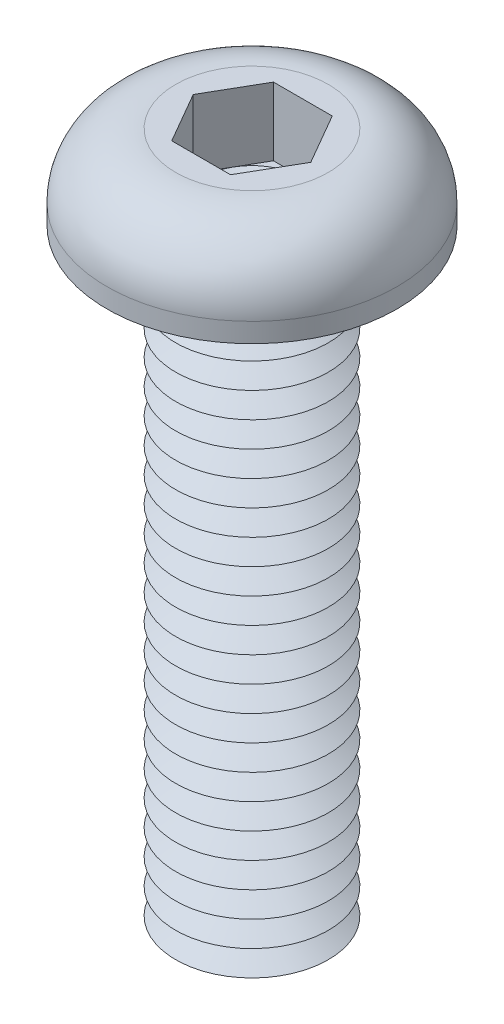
ISO-10303-21;
HEADER;
FILE_DESCRIPTION(('STEP AP214'),'2;1');
FILE_NAME('part.step','',(''),(''),'','','');
FILE_SCHEMA(('AUTOMOTIVE_DESIGN { 1 0 10303 214 1 1 1 1 }'));
ENDSEC;
DATA;
#1=APPLICATION_CONTEXT('core data for automotive mechanical design processes');
#2=APPLICATION_PROTOCOL_DEFINITION('international standard','automotive_design',2000,#1);
#3=PRODUCT_CONTEXT('',#1,'mechanical');
#4=PRODUCT('Part','Part','',(#3));
#5=PRODUCT_RELATED_PRODUCT_CATEGORY('part','',(#4));
#6=PRODUCT_DEFINITION_FORMATION('','',#4);
#7=PRODUCT_DEFINITION_CONTEXT('part definition',#1,'design');
#8=PRODUCT_DEFINITION('design','',#6,#7);
#9=PRODUCT_DEFINITION_SHAPE('','',#8);
#10=(LENGTH_UNIT() NAMED_UNIT(*) SI_UNIT(.MILLI.,.METRE.));
#11=(NAMED_UNIT(*) PLANE_ANGLE_UNIT() SI_UNIT($,.RADIAN.));
#12=(NAMED_UNIT(*) SI_UNIT($,.STERADIAN.) SOLID_ANGLE_UNIT());
#13=UNCERTAINTY_MEASURE_WITH_UNIT(LENGTH_MEASURE(1.E-05),#10,'distance_accuracy_value','');
#14=(GEOMETRIC_REPRESENTATION_CONTEXT(3) GLOBAL_UNCERTAINTY_ASSIGNED_CONTEXT((#13)) GLOBAL_UNIT_ASSIGNED_CONTEXT((#10,
#11,#12)) REPRESENTATION_CONTEXT('',''));
#15=CARTESIAN_POINT('',(0.,0.,0.));
#16=DIRECTION('',(0.,0.,1.));
#17=DIRECTION('',(1.,0.,0.));
#18=AXIS2_PLACEMENT_3D('',#15,#16,#17);
#19=CARTESIAN_POINT('',(0.,0.,0.));
#20=DIRECTION('',(0.,-1.,0.));
#21=DIRECTION('',(0.,0.,-1.));
#22=AXIS2_PLACEMENT_3D('',#19,#20,#21);
#23=TOROIDAL_SURFACE('',#22,1.75,0.25);
#24=CARTESIAN_POINT('',(0.,0.,-2.));
#25=VERTEX_POINT('',#24);
#26=VERTEX_LOOP('',#25);
#27=FACE_BOUND('',#26,.T.);
#28=ADVANCED_FACE('P0_F12',(#27),#23,.T.);
#29=CLOSED_SHELL('',(#28));
#30=MANIFOLD_SOLID_BREP('P0_B1',#29);
#31=CARTESIAN_POINT('',(0.577350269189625,0.31,-1.));
#32=DIRECTION('',(0.,1.,0.));
#33=DIRECTION('',(0.,0.,1.));
#34=AXIS2_PLACEMENT_3D('',#31,#32,#33);
#35=PLANE('',#34);
#36=CARTESIAN_POINT('',(0.,0.31,0.));
#37=DIRECTION('',(0.,1.,0.));
#38=DIRECTION('',(0.,0.,1.));
#39=AXIS2_PLACEMENT_3D('',#36,#37,#38);
#40=CIRCLE('',#39,1.);
#41=CARTESIAN_POINT('',(0.,0.31,1.));
#42=VERTEX_POINT('',#41);
#43=CARTESIAN_POINT('',(0.866025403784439,0.31,0.5));
#44=VERTEX_POINT('',#43);
#45=EDGE_CURVE('P1_E93',#42,#44,#40,.T.);
#46=ORIENTED_EDGE('',*,*,#45,.F.);
#47=DIRECTION('',(1.,0.,0.));
#48=VECTOR('',#47,1.);
#49=CARTESIAN_POINT('',(-0.577350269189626,0.31,1.));
#50=LINE('',#49,#48);
#51=CARTESIAN_POINT('',(0.577350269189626,0.31,1.));
#52=VERTEX_POINT('',#51);
#53=EDGE_CURVE('P1_E116',#42,#52,#50,.T.);
#54=ORIENTED_EDGE('',*,*,#53,.T.);
#55=DIRECTION('',(0.5,0.,-0.866025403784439));
#56=VECTOR('',#55,1.);
#57=CARTESIAN_POINT('',(0.577350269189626,0.31,1.));
#58=LINE('',#57,#56);
#59=EDGE_CURVE('P1_E112',#52,#44,#58,.T.);
#60=ORIENTED_EDGE('',*,*,#59,.T.);
#61=EDGE_LOOP('',(#46,#54,#60));
#62=FACE_BOUND('',#61,.T.);
#63=ADVANCED_FACE('P1_F15',(#62),#35,.T.);
#64=CARTESIAN_POINT('',(0.,0.31,0.));
#65=DIRECTION('',(0.,1.,0.));
#66=DIRECTION('',(0.,0.,1.));
#67=AXIS2_PLACEMENT_3D('',#64,#65,#66);
#68=CIRCLE('',#67,1.);
#69=CARTESIAN_POINT('',(0.866025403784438,0.31,-0.5));
#70=VERTEX_POINT('',#69);
#71=EDGE_CURVE('P1_E10',#44,#70,#68,.T.);
#72=ORIENTED_EDGE('',*,*,#71,.F.);
#73=CARTESIAN_POINT('',(1.15470053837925,0.31,0.));
#74=VERTEX_POINT('',#73);
#75=EDGE_CURVE('P1_E104',#44,#74,#58,.T.);
#76=ORIENTED_EDGE('',*,*,#75,.T.);
#77=DIRECTION('',(-0.5,0.,-0.866025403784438));
#78=VECTOR('',#77,1.);
#79=CARTESIAN_POINT('',(1.15470053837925,0.31,0.));
#80=LINE('',#79,#78);
#81=EDGE_CURVE('P1_E107',#74,#70,#80,.T.);
#82=ORIENTED_EDGE('',*,*,#81,.T.);
#83=EDGE_LOOP('',(#72,#76,#82));
#84=FACE_BOUND('',#83,.T.);
#85=ADVANCED_FACE('P1_F103',(#84),#35,.T.);
#86=CARTESIAN_POINT('',(0.,0.31,-1.));
#87=VERTEX_POINT('',#86);
#88=EDGE_CURVE('P1_E24',#70,#87,#68,.T.);
#89=ORIENTED_EDGE('',*,*,#88,.F.);
#90=CARTESIAN_POINT('',(0.577350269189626,0.31,-1.));
#91=VERTEX_POINT('',#90);
#92=EDGE_CURVE('P1_E139',#70,#91,#80,.T.);
#93=ORIENTED_EDGE('',*,*,#92,.T.);
#94=DIRECTION('',(-1.,0.,0.));
#95=VECTOR('',#94,1.);
#96=CARTESIAN_POINT('',(0.577350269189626,0.31,-1.));
#97=LINE('',#96,#95);
#98=EDGE_CURVE('P1_E360',#91,#87,#97,.T.);
#99=ORIENTED_EDGE('',*,*,#98,.T.);
#100=EDGE_LOOP('',(#89,#93,#99));
#101=FACE_BOUND('',#100,.T.);
#102=ADVANCED_FACE('P1_F325',(#101),#35,.T.);
#103=CARTESIAN_POINT('',(-0.866025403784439,0.31,-0.5));
#104=VERTEX_POINT('',#103);
#105=EDGE_CURVE('P1_E355',#87,#104,#68,.T.);
#106=ORIENTED_EDGE('',*,*,#105,.F.);
#107=CARTESIAN_POINT('',(-0.577350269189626,0.31,-1.));
#108=VERTEX_POINT('',#107);
#109=EDGE_CURVE('P1_E364',#87,#108,#97,.T.);
#110=ORIENTED_EDGE('',*,*,#109,.T.);
#111=DIRECTION('',(-0.5,0.,0.866025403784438));
#112=VECTOR('',#111,1.);
#113=CARTESIAN_POINT('',(-0.577350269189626,0.31,-1.));
#114=LINE('',#113,#112);
#115=EDGE_CURVE('P1_E359',#108,#104,#114,.T.);
#116=ORIENTED_EDGE('',*,*,#115,.T.);
#117=EDGE_LOOP('',(#106,#110,#116));
#118=FACE_BOUND('',#117,.T.);
#119=ADVANCED_FACE('P1_F339',(#118),#35,.T.);
#120=CARTESIAN_POINT('',(-0.866025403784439,0.31,0.5));
#121=VERTEX_POINT('',#120);
#122=EDGE_CURVE('P1_E31',#104,#121,#68,.T.);
#123=ORIENTED_EDGE('',*,*,#122,.F.);
#124=CARTESIAN_POINT('',(-1.15470053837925,0.31,0.));
#125=VERTEX_POINT('',#124);
#126=EDGE_CURVE('P1_E351',#104,#125,#114,.T.);
#127=ORIENTED_EDGE('',*,*,#126,.T.);
#128=DIRECTION('',(0.5,0.,0.866025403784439));
#129=VECTOR('',#128,1.);
#130=CARTESIAN_POINT('',(-1.15470053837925,0.31,0.));
#131=LINE('',#130,#129);
#132=EDGE_CURVE('P1_E354',#125,#121,#131,.T.);
#133=ORIENTED_EDGE('',*,*,#132,.T.);
#134=EDGE_LOOP('',(#123,#127,#133));
#135=FACE_BOUND('',#134,.T.);
#136=ADVANCED_FACE('P1_F330',(#135),#35,.T.);
#137=CARTESIAN_POINT('',(0.,-11.5,0.));
#138=DIRECTION('',(0.,1.,0.));
#139=DIRECTION('',(0.,0.,1.));
#140=AXIS2_PLACEMENT_3D('',#137,#138,#139);
#141=CONICAL_SURFACE('',#140,1.06698729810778,1.0471975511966);
#142=CARTESIAN_POINT('',(0.,-11.25,0.));
#143=DIRECTION('',(0.,-1.,0.));
#144=DIRECTION('',(0.,0.,-1.));
#145=AXIS2_PLACEMENT_3D('',#142,#143,#144);
#146=CIRCLE('',#145,1.5);
#147=CARTESIAN_POINT('',(0.,-11.25,-1.5));
#148=VERTEX_POINT('',#147);
#149=EDGE_CURVE('P1_E287',#148,#148,#146,.T.);
#150=ORIENTED_EDGE('',*,*,#149,.T.);
#151=EDGE_LOOP('',(#150));
#152=FACE_BOUND('',#151,.T.);
#153=CARTESIAN_POINT('',(0.,-11.5,0.));
#154=DIRECTION('',(0.,-1.,0.));
#155=DIRECTION('',(0.,0.,-1.));
#156=AXIS2_PLACEMENT_3D('',#153,#154,#155);
#157=CIRCLE('',#156,1.06698729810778);
#158=CARTESIAN_POINT('',(0.,-11.5,-1.06698729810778));
#159=VERTEX_POINT('',#158);
#160=EDGE_CURVE('P1_E290',#159,#159,#157,.T.);
#161=ORIENTED_EDGE('',*,*,#160,.F.);
#162=EDGE_LOOP('',(#161));
#163=FACE_BOUND('',#162,.T.);
#164=ADVANCED_FACE('P1_F338',(#152,#163),#141,.T.);
#165=CARTESIAN_POINT('',(0.,-11.75,0.));
#166=DIRECTION('',(0.,-1.,0.));
#167=DIRECTION('',(0.,0.,-1.));
#168=AXIS2_PLACEMENT_3D('',#165,#166,#167);
#169=CONICAL_SURFACE('',#168,1.5,1.0471975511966);
#170=ORIENTED_EDGE('',*,*,#160,.T.);
#171=EDGE_LOOP('',(#170));
#172=FACE_BOUND('',#171,.T.);
#173=CARTESIAN_POINT('',(0.,-11.75,0.));
#174=DIRECTION('',(0.,-1.,0.));
#175=DIRECTION('',(0.,0.,-1.));
#176=AXIS2_PLACEMENT_3D('',#173,#174,#175);
#177=CIRCLE('',#176,1.5);
#178=CARTESIAN_POINT('',(0.,-11.75,-1.5));
#179=VERTEX_POINT('',#178);
#180=EDGE_CURVE('P1_E293',#179,#179,#177,.T.);
#181=ORIENTED_EDGE('',*,*,#180,.F.);
#182=EDGE_LOOP('',(#181));
#183=FACE_BOUND('',#182,.T.);
#184=ADVANCED_FACE('P1_F345',(#172,#183),#169,.T.);
#185=CARTESIAN_POINT('',(0.,-12.,0.));
#186=DIRECTION('',(0.,1.,0.));
#187=DIRECTION('',(0.,0.,1.));
#188=AXIS2_PLACEMENT_3D('',#185,#186,#187);
#189=PLANE('',#188);
#190=CARTESIAN_POINT('',(0.,-12.,0.));
#191=DIRECTION('',(0.,-1.,0.));
#192=DIRECTION('',(0.,0.,-1.));
#193=AXIS2_PLACEMENT_3D('',#190,#191,#192);
#194=CIRCLE('',#193,1.06698729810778);
#195=CARTESIAN_POINT('',(0.,-12.,-1.06698729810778));
#196=VERTEX_POINT('',#195);
#197=EDGE_CURVE('P1_E296',#196,#196,#194,.T.);
#198=ORIENTED_EDGE('',*,*,#197,.T.);
#199=EDGE_LOOP('',(#198));
#200=FACE_BOUND('',#199,.T.);
#201=ADVANCED_FACE('P1_F423',(#200),#189,.F.);
#202=CARTESIAN_POINT('',(0.,-12.,0.));
#203=DIRECTION('',(0.,1.,0.));
#204=DIRECTION('',(0.,0.,1.));
#205=AXIS2_PLACEMENT_3D('',#202,#203,#204);
#206=CONICAL_SURFACE('',#205,1.06698729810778,1.0471975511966);
#207=ORIENTED_EDGE('',*,*,#180,.T.);
#208=EDGE_LOOP('',(#207));
#209=FACE_BOUND('',#208,.T.);
#210=ORIENTED_EDGE('',*,*,#197,.F.);
#211=EDGE_LOOP('',(#210));
#212=FACE_BOUND('',#211,.T.);
#213=ADVANCED_FACE('P1_F434',(#209,#212),#206,.T.);
#214=CARTESIAN_POINT('',(0.,-11.,0.));
#215=DIRECTION('',(0.,1.,0.));
#216=DIRECTION('',(0.,0.,1.));
#217=AXIS2_PLACEMENT_3D('',#214,#215,#216);
#218=CONICAL_SURFACE('',#217,1.06698729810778,1.0471975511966);
#219=CARTESIAN_POINT('',(0.,-10.75,0.));
#220=DIRECTION('',(0.,-1.,0.));
#221=DIRECTION('',(0.,0.,-1.));
#222=AXIS2_PLACEMENT_3D('',#219,#220,#221);
#223=CIRCLE('',#222,1.5);
#224=CARTESIAN_POINT('',(0.,-10.75,-1.5));
#225=VERTEX_POINT('',#224);
#226=EDGE_CURVE('P1_E281',#225,#225,#223,.T.);
#227=ORIENTED_EDGE('',*,*,#226,.T.);
#228=EDGE_LOOP('',(#227));
#229=FACE_BOUND('',#228,.T.);
#230=CARTESIAN_POINT('',(0.,-11.,0.));
#231=DIRECTION('',(0.,-1.,0.));
#232=DIRECTION('',(0.,0.,-1.));
#233=AXIS2_PLACEMENT_3D('',#230,#231,#232);
#234=CIRCLE('',#233,1.06698729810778);
#235=CARTESIAN_POINT('',(0.,-11.,-1.06698729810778));
#236=VERTEX_POINT('',#235);
#237=EDGE_CURVE('P1_E284',#236,#236,#234,.T.);
#238=ORIENTED_EDGE('',*,*,#237,.F.);
#239=EDGE_LOOP('',(#238));
#240=FACE_BOUND('',#239,.T.);
#241=ADVANCED_FACE('P1_F443',(#229,#240),#218,.T.);
#242=CARTESIAN_POINT('',(0.,-11.25,0.));
#243=DIRECTION('',(0.,-1.,0.));
#244=DIRECTION('',(0.,0.,-1.));
#245=AXIS2_PLACEMENT_3D('',#242,#243,#244);
#246=CONICAL_SURFACE('',#245,1.5,1.0471975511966);
#247=ORIENTED_EDGE('',*,*,#237,.T.);
#248=EDGE_LOOP('',(#247));
#249=FACE_BOUND('',#248,.T.);
#250=ORIENTED_EDGE('',*,*,#149,.F.);
#251=EDGE_LOOP('',(#250));
#252=FACE_BOUND('',#251,.T.);
#253=ADVANCED_FACE('P1_F452',(#249,#252),#246,.T.);
#254=CARTESIAN_POINT('',(0.,-10.5,0.));
#255=DIRECTION('',(0.,1.,0.));
#256=DIRECTION('',(0.,0.,1.));
#257=AXIS2_PLACEMENT_3D('',#254,#255,#256);
#258=CONICAL_SURFACE('',#257,1.06698729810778,1.0471975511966);
#259=CARTESIAN_POINT('',(0.,-10.25,0.));
#260=DIRECTION('',(0.,-1.,0.));
#261=DIRECTION('',(0.,0.,-1.));
#262=AXIS2_PLACEMENT_3D('',#259,#260,#261);
#263=CIRCLE('',#262,1.5);
#264=CARTESIAN_POINT('',(0.,-10.25,-1.5));
#265=VERTEX_POINT('',#264);
#266=EDGE_CURVE('P1_E275',#265,#265,#263,.T.);
#267=ORIENTED_EDGE('',*,*,#266,.T.);
#268=EDGE_LOOP('',(#267));
#269=FACE_BOUND('',#268,.T.);
#270=CARTESIAN_POINT('',(0.,-10.5,0.));
#271=DIRECTION('',(0.,-1.,0.));
#272=DIRECTION('',(0.,0.,-1.));
#273=AXIS2_PLACEMENT_3D('',#270,#271,#272);
#274=CIRCLE('',#273,1.06698729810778);
#275=CARTESIAN_POINT('',(0.,-10.5,-1.06698729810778));
#276=VERTEX_POINT('',#275);
#277=EDGE_CURVE('P1_E278',#276,#276,#274,.T.);
#278=ORIENTED_EDGE('',*,*,#277,.F.);
#279=EDGE_LOOP('',(#278));
#280=FACE_BOUND('',#279,.T.);
#281=ADVANCED_FACE('P1_F462',(#269,#280),#258,.T.);
#282=CARTESIAN_POINT('',(0.,-10.75,0.));
#283=DIRECTION('',(0.,-1.,0.));
#284=DIRECTION('',(0.,0.,-1.));
#285=AXIS2_PLACEMENT_3D('',#282,#283,#284);
#286=CONICAL_SURFACE('',#285,1.5,1.0471975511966);
#287=ORIENTED_EDGE('',*,*,#277,.T.);
#288=EDGE_LOOP('',(#287));
#289=FACE_BOUND('',#288,.T.);
#290=ORIENTED_EDGE('',*,*,#226,.F.);
#291=EDGE_LOOP('',(#290));
#292=FACE_BOUND('',#291,.T.);
#293=ADVANCED_FACE('P1_F472',(#289,#292),#286,.T.);
#294=CARTESIAN_POINT('',(0.,-10.,0.));
#295=DIRECTION('',(0.,1.,0.));
#296=DIRECTION('',(0.,0.,1.));
#297=AXIS2_PLACEMENT_3D('',#294,#295,#296);
#298=CONICAL_SURFACE('',#297,1.06698729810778,1.0471975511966);
#299=CARTESIAN_POINT('',(0.,-9.75,0.));
#300=DIRECTION('',(0.,-1.,0.));
#301=DIRECTION('',(0.,0.,-1.));
#302=AXIS2_PLACEMENT_3D('',#299,#300,#301);
#303=CIRCLE('',#302,1.5);
#304=CARTESIAN_POINT('',(0.,-9.75,-1.5));
#305=VERTEX_POINT('',#304);
#306=EDGE_CURVE('P1_E269',#305,#305,#303,.T.);
#307=ORIENTED_EDGE('',*,*,#306,.T.);
#308=EDGE_LOOP('',(#307));
#309=FACE_BOUND('',#308,.T.);
#310=CARTESIAN_POINT('',(0.,-10.,0.));
#311=DIRECTION('',(0.,-1.,0.));
#312=DIRECTION('',(0.,0.,-1.));
#313=AXIS2_PLACEMENT_3D('',#310,#311,#312);
#314=CIRCLE('',#313,1.06698729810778);
#315=CARTESIAN_POINT('',(0.,-10.,-1.06698729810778));
#316=VERTEX_POINT('',#315);
#317=EDGE_CURVE('P1_E272',#316,#316,#314,.T.);
#318=ORIENTED_EDGE('',*,*,#317,.F.);
#319=EDGE_LOOP('',(#318));
#320=FACE_BOUND('',#319,.T.);
#321=ADVANCED_FACE('P1_F482',(#309,#320),#298,.T.);
#322=CARTESIAN_POINT('',(0.,-10.25,0.));
#323=DIRECTION('',(0.,-1.,0.));
#324=DIRECTION('',(0.,0.,-1.));
#325=AXIS2_PLACEMENT_3D('',#322,#323,#324);
#326=CONICAL_SURFACE('',#325,1.5,1.0471975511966);
#327=ORIENTED_EDGE('',*,*,#317,.T.);
#328=EDGE_LOOP('',(#327));
#329=FACE_BOUND('',#328,.T.);
#330=ORIENTED_EDGE('',*,*,#266,.F.);
#331=EDGE_LOOP('',(#330));
#332=FACE_BOUND('',#331,.T.);
#333=ADVANCED_FACE('P1_F492',(#329,#332),#326,.T.);
#334=CARTESIAN_POINT('',(0.,-9.5,0.));
#335=DIRECTION('',(0.,1.,0.));
#336=DIRECTION('',(0.,0.,1.));
#337=AXIS2_PLACEMENT_3D('',#334,#335,#336);
#338=CONICAL_SURFACE('',#337,1.06698729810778,1.0471975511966);
#339=CARTESIAN_POINT('',(0.,-9.25,0.));
#340=DIRECTION('',(0.,-1.,0.));
#341=DIRECTION('',(0.,0.,-1.));
#342=AXIS2_PLACEMENT_3D('',#339,#340,#341);
#343=CIRCLE('',#342,1.5);
#344=CARTESIAN_POINT('',(0.,-9.25,-1.5));
#345=VERTEX_POINT('',#344);
#346=EDGE_CURVE('P1_E263',#345,#345,#343,.T.);
#347=ORIENTED_EDGE('',*,*,#346,.T.);
#348=EDGE_LOOP('',(#347));
#349=FACE_BOUND('',#348,.T.);
#350=CARTESIAN_POINT('',(0.,-9.5,0.));
#351=DIRECTION('',(0.,-1.,0.));
#352=DIRECTION('',(0.,0.,-1.));
#353=AXIS2_PLACEMENT_3D('',#350,#351,#352);
#354=CIRCLE('',#353,1.06698729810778);
#355=CARTESIAN_POINT('',(0.,-9.5,-1.06698729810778));
#356=VERTEX_POINT('',#355);
#357=EDGE_CURVE('P1_E266',#356,#356,#354,.T.);
#358=ORIENTED_EDGE('',*,*,#357,.F.);
#359=EDGE_LOOP('',(#358));
#360=FACE_BOUND('',#359,.T.);
#361=ADVANCED_FACE('P1_F502',(#349,#360),#338,.T.);
#362=CARTESIAN_POINT('',(0.,-9.75,0.));
#363=DIRECTION('',(0.,-1.,0.));
#364=DIRECTION('',(0.,0.,-1.));
#365=AXIS2_PLACEMENT_3D('',#362,#363,#364);
#366=CONICAL_SURFACE('',#365,1.5,1.0471975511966);
#367=ORIENTED_EDGE('',*,*,#357,.T.);
#368=EDGE_LOOP('',(#367));
#369=FACE_BOUND('',#368,.T.);
#370=ORIENTED_EDGE('',*,*,#306,.F.);
#371=EDGE_LOOP('',(#370));
#372=FACE_BOUND('',#371,.T.);
#373=ADVANCED_FACE('P1_F512',(#369,#372),#366,.T.);
#374=CARTESIAN_POINT('',(0.,-9.,0.));
#375=DIRECTION('',(0.,1.,0.));
#376=DIRECTION('',(0.,0.,1.));
#377=AXIS2_PLACEMENT_3D('',#374,#375,#376);
#378=CONICAL_SURFACE('',#377,1.06698729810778,1.0471975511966);
#379=CARTESIAN_POINT('',(0.,-8.75,0.));
#380=DIRECTION('',(0.,-1.,0.));
#381=DIRECTION('',(0.,0.,-1.));
#382=AXIS2_PLACEMENT_3D('',#379,#380,#381);
#383=CIRCLE('',#382,1.5);
#384=CARTESIAN_POINT('',(0.,-8.75,-1.5));
#385=VERTEX_POINT('',#384);
#386=EDGE_CURVE('P1_E257',#385,#385,#383,.T.);
#387=ORIENTED_EDGE('',*,*,#386,.T.);
#388=EDGE_LOOP('',(#387));
#389=FACE_BOUND('',#388,.T.);
#390=CARTESIAN_POINT('',(0.,-9.,0.));
#391=DIRECTION('',(0.,-1.,0.));
#392=DIRECTION('',(0.,0.,-1.));
#393=AXIS2_PLACEMENT_3D('',#390,#391,#392);
#394=CIRCLE('',#393,1.06698729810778);
#395=CARTESIAN_POINT('',(0.,-9.,-1.06698729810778));
#396=VERTEX_POINT('',#395);
#397=EDGE_CURVE('P1_E260',#396,#396,#394,.T.);
#398=ORIENTED_EDGE('',*,*,#397,.F.);
#399=EDGE_LOOP('',(#398));
#400=FACE_BOUND('',#399,.T.);
#401=ADVANCED_FACE('P1_F522',(#389,#400),#378,.T.);
#402=CARTESIAN_POINT('',(0.,-9.25,0.));
#403=DIRECTION('',(0.,-1.,0.));
#404=DIRECTION('',(0.,0.,-1.));
#405=AXIS2_PLACEMENT_3D('',#402,#403,#404);
#406=CONICAL_SURFACE('',#405,1.5,1.0471975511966);
#407=ORIENTED_EDGE('',*,*,#397,.T.);
#408=EDGE_LOOP('',(#407));
#409=FACE_BOUND('',#408,.T.);
#410=ORIENTED_EDGE('',*,*,#346,.F.);
#411=EDGE_LOOP('',(#410));
#412=FACE_BOUND('',#411,.T.);
#413=ADVANCED_FACE('P1_F532',(#409,#412),#406,.T.);
#414=CARTESIAN_POINT('',(0.,-8.5,0.));
#415=DIRECTION('',(0.,1.,0.));
#416=DIRECTION('',(0.,0.,1.));
#417=AXIS2_PLACEMENT_3D('',#414,#415,#416);
#418=CONICAL_SURFACE('',#417,1.06698729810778,1.0471975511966);
#419=CARTESIAN_POINT('',(0.,-8.25,0.));
#420=DIRECTION('',(0.,-1.,0.));
#421=DIRECTION('',(0.,0.,-1.));
#422=AXIS2_PLACEMENT_3D('',#419,#420,#421);
#423=CIRCLE('',#422,1.5);
#424=CARTESIAN_POINT('',(0.,-8.25,-1.5));
#425=VERTEX_POINT('',#424);
#426=EDGE_CURVE('P1_E251',#425,#425,#423,.T.);
#427=ORIENTED_EDGE('',*,*,#426,.T.);
#428=EDGE_LOOP('',(#427));
#429=FACE_BOUND('',#428,.T.);
#430=CARTESIAN_POINT('',(0.,-8.5,0.));
#431=DIRECTION('',(0.,-1.,0.));
#432=DIRECTION('',(0.,0.,-1.));
#433=AXIS2_PLACEMENT_3D('',#430,#431,#432);
#434=CIRCLE('',#433,1.06698729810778);
#435=CARTESIAN_POINT('',(0.,-8.5,-1.06698729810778));
#436=VERTEX_POINT('',#435);
#437=EDGE_CURVE('P1_E254',#436,#436,#434,.T.);
#438=ORIENTED_EDGE('',*,*,#437,.F.);
#439=EDGE_LOOP('',(#438));
#440=FACE_BOUND('',#439,.T.);
#441=ADVANCED_FACE('P1_F542',(#429,#440),#418,.T.);
#442=CARTESIAN_POINT('',(0.,-8.75,0.));
#443=DIRECTION('',(0.,-1.,0.));
#444=DIRECTION('',(0.,0.,-1.));
#445=AXIS2_PLACEMENT_3D('',#442,#443,#444);
#446=CONICAL_SURFACE('',#445,1.5,1.0471975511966);
#447=ORIENTED_EDGE('',*,*,#437,.T.);
#448=EDGE_LOOP('',(#447));
#449=FACE_BOUND('',#448,.T.);
#450=ORIENTED_EDGE('',*,*,#386,.F.);
#451=EDGE_LOOP('',(#450));
#452=FACE_BOUND('',#451,.T.);
#453=ADVANCED_FACE('P1_F552',(#449,#452),#446,.T.);
#454=CARTESIAN_POINT('',(0.,-8.,0.));
#455=DIRECTION('',(0.,1.,0.));
#456=DIRECTION('',(0.,0.,1.));
#457=AXIS2_PLACEMENT_3D('',#454,#455,#456);
#458=CONICAL_SURFACE('',#457,1.06698729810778,1.0471975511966);
#459=CARTESIAN_POINT('',(0.,-7.75,0.));
#460=DIRECTION('',(0.,-1.,0.));
#461=DIRECTION('',(0.,0.,-1.));
#462=AXIS2_PLACEMENT_3D('',#459,#460,#461);
#463=CIRCLE('',#462,1.5);
#464=CARTESIAN_POINT('',(0.,-7.75,-1.5));
#465=VERTEX_POINT('',#464);
#466=EDGE_CURVE('P1_E245',#465,#465,#463,.T.);
#467=ORIENTED_EDGE('',*,*,#466,.T.);
#468=EDGE_LOOP('',(#467));
#469=FACE_BOUND('',#468,.T.);
#470=CARTESIAN_POINT('',(0.,-8.,0.));
#471=DIRECTION('',(0.,-1.,0.));
#472=DIRECTION('',(0.,0.,-1.));
#473=AXIS2_PLACEMENT_3D('',#470,#471,#472);
#474=CIRCLE('',#473,1.06698729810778);
#475=CARTESIAN_POINT('',(0.,-8.,-1.06698729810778));
#476=VERTEX_POINT('',#475);
#477=EDGE_CURVE('P1_E248',#476,#476,#474,.T.);
#478=ORIENTED_EDGE('',*,*,#477,.F.);
#479=EDGE_LOOP('',(#478));
#480=FACE_BOUND('',#479,.T.);
#481=ADVANCED_FACE('P1_F562',(#469,#480),#458,.T.);
#482=CARTESIAN_POINT('',(0.,-8.25,0.));
#483=DIRECTION('',(0.,-1.,0.));
#484=DIRECTION('',(0.,0.,-1.));
#485=AXIS2_PLACEMENT_3D('',#482,#483,#484);
#486=CONICAL_SURFACE('',#485,1.5,1.0471975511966);
#487=ORIENTED_EDGE('',*,*,#477,.T.);
#488=EDGE_LOOP('',(#487));
#489=FACE_BOUND('',#488,.T.);
#490=ORIENTED_EDGE('',*,*,#426,.F.);
#491=EDGE_LOOP('',(#490));
#492=FACE_BOUND('',#491,.T.);
#493=ADVANCED_FACE('P1_F572',(#489,#492),#486,.T.);
#494=CARTESIAN_POINT('',(0.,-7.5,0.));
#495=DIRECTION('',(0.,1.,0.));
#496=DIRECTION('',(0.,0.,1.));
#497=AXIS2_PLACEMENT_3D('',#494,#495,#496);
#498=CONICAL_SURFACE('',#497,1.06698729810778,1.0471975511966);
#499=CARTESIAN_POINT('',(0.,-7.25,0.));
#500=DIRECTION('',(0.,-1.,0.));
#501=DIRECTION('',(0.,0.,-1.));
#502=AXIS2_PLACEMENT_3D('',#499,#500,#501);
#503=CIRCLE('',#502,1.5);
#504=CARTESIAN_POINT('',(0.,-7.25,-1.5));
#505=VERTEX_POINT('',#504);
#506=EDGE_CURVE('P1_E239',#505,#505,#503,.T.);
#507=ORIENTED_EDGE('',*,*,#506,.T.);
#508=EDGE_LOOP('',(#507));
#509=FACE_BOUND('',#508,.T.);
#510=CARTESIAN_POINT('',(0.,-7.5,0.));
#511=DIRECTION('',(0.,-1.,0.));
#512=DIRECTION('',(0.,0.,-1.));
#513=AXIS2_PLACEMENT_3D('',#510,#511,#512);
#514=CIRCLE('',#513,1.06698729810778);
#515=CARTESIAN_POINT('',(0.,-7.5,-1.06698729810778));
#516=VERTEX_POINT('',#515);
#517=EDGE_CURVE('P1_E242',#516,#516,#514,.T.);
#518=ORIENTED_EDGE('',*,*,#517,.F.);
#519=EDGE_LOOP('',(#518));
#520=FACE_BOUND('',#519,.T.);
#521=ADVANCED_FACE('P1_F582',(#509,#520),#498,.T.);
#522=CARTESIAN_POINT('',(0.,-7.75,0.));
#523=DIRECTION('',(0.,-1.,0.));
#524=DIRECTION('',(0.,0.,-1.));
#525=AXIS2_PLACEMENT_3D('',#522,#523,#524);
#526=CONICAL_SURFACE('',#525,1.5,1.0471975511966);
#527=ORIENTED_EDGE('',*,*,#517,.T.);
#528=EDGE_LOOP('',(#527));
#529=FACE_BOUND('',#528,.T.);
#530=ORIENTED_EDGE('',*,*,#466,.F.);
#531=EDGE_LOOP('',(#530));
#532=FACE_BOUND('',#531,.T.);
#533=ADVANCED_FACE('P1_F592',(#529,#532),#526,.T.);
#534=CARTESIAN_POINT('',(0.,-7.,0.));
#535=DIRECTION('',(0.,1.,0.));
#536=DIRECTION('',(0.,0.,1.));
#537=AXIS2_PLACEMENT_3D('',#534,#535,#536);
#538=CONICAL_SURFACE('',#537,1.06698729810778,1.0471975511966);
#539=CARTESIAN_POINT('',(0.,-6.75,0.));
#540=DIRECTION('',(0.,-1.,0.));
#541=DIRECTION('',(0.,0.,-1.));
#542=AXIS2_PLACEMENT_3D('',#539,#540,#541);
#543=CIRCLE('',#542,1.5);
#544=CARTESIAN_POINT('',(0.,-6.75,-1.5));
#545=VERTEX_POINT('',#544);
#546=EDGE_CURVE('P1_E233',#545,#545,#543,.T.);
#547=ORIENTED_EDGE('',*,*,#546,.T.);
#548=EDGE_LOOP('',(#547));
#549=FACE_BOUND('',#548,.T.);
#550=CARTESIAN_POINT('',(0.,-7.,0.));
#551=DIRECTION('',(0.,-1.,0.));
#552=DIRECTION('',(0.,0.,-1.));
#553=AXIS2_PLACEMENT_3D('',#550,#551,#552);
#554=CIRCLE('',#553,1.06698729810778);
#555=CARTESIAN_POINT('',(0.,-7.,-1.06698729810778));
#556=VERTEX_POINT('',#555);
#557=EDGE_CURVE('P1_E236',#556,#556,#554,.T.);
#558=ORIENTED_EDGE('',*,*,#557,.F.);
#559=EDGE_LOOP('',(#558));
#560=FACE_BOUND('',#559,.T.);
#561=ADVANCED_FACE('P1_F602',(#549,#560),#538,.T.);
#562=CARTESIAN_POINT('',(0.,-7.25,0.));
#563=DIRECTION('',(0.,-1.,0.));
#564=DIRECTION('',(0.,0.,-1.));
#565=AXIS2_PLACEMENT_3D('',#562,#563,#564);
#566=CONICAL_SURFACE('',#565,1.5,1.0471975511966);
#567=ORIENTED_EDGE('',*,*,#557,.T.);
#568=EDGE_LOOP('',(#567));
#569=FACE_BOUND('',#568,.T.);
#570=ORIENTED_EDGE('',*,*,#506,.F.);
#571=EDGE_LOOP('',(#570));
#572=FACE_BOUND('',#571,.T.);
#573=ADVANCED_FACE('P1_F612',(#569,#572),#566,.T.);
#574=CARTESIAN_POINT('',(0.,-6.5,0.));
#575=DIRECTION('',(0.,1.,0.));
#576=DIRECTION('',(0.,0.,1.));
#577=AXIS2_PLACEMENT_3D('',#574,#575,#576);
#578=CONICAL_SURFACE('',#577,1.06698729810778,1.0471975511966);
#579=CARTESIAN_POINT('',(0.,-6.25,0.));
#580=DIRECTION('',(0.,-1.,0.));
#581=DIRECTION('',(0.,0.,-1.));
#582=AXIS2_PLACEMENT_3D('',#579,#580,#581);
#583=CIRCLE('',#582,1.5);
#584=CARTESIAN_POINT('',(0.,-6.25,-1.5));
#585=VERTEX_POINT('',#584);
#586=EDGE_CURVE('P1_E227',#585,#585,#583,.T.);
#587=ORIENTED_EDGE('',*,*,#586,.T.);
#588=EDGE_LOOP('',(#587));
#589=FACE_BOUND('',#588,.T.);
#590=CARTESIAN_POINT('',(0.,-6.5,0.));
#591=DIRECTION('',(0.,-1.,0.));
#592=DIRECTION('',(0.,0.,-1.));
#593=AXIS2_PLACEMENT_3D('',#590,#591,#592);
#594=CIRCLE('',#593,1.06698729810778);
#595=CARTESIAN_POINT('',(0.,-6.5,-1.06698729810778));
#596=VERTEX_POINT('',#595);
#597=EDGE_CURVE('P1_E230',#596,#596,#594,.T.);
#598=ORIENTED_EDGE('',*,*,#597,.F.);
#599=EDGE_LOOP('',(#598));
#600=FACE_BOUND('',#599,.T.);
#601=ADVANCED_FACE('P1_F622',(#589,#600),#578,.T.);
#602=CARTESIAN_POINT('',(0.,-6.75,0.));
#603=DIRECTION('',(0.,-1.,0.));
#604=DIRECTION('',(0.,0.,-1.));
#605=AXIS2_PLACEMENT_3D('',#602,#603,#604);
#606=CONICAL_SURFACE('',#605,1.5,1.0471975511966);
#607=ORIENTED_EDGE('',*,*,#597,.T.);
#608=EDGE_LOOP('',(#607));
#609=FACE_BOUND('',#608,.T.);
#610=ORIENTED_EDGE('',*,*,#546,.F.);
#611=EDGE_LOOP('',(#610));
#612=FACE_BOUND('',#611,.T.);
#613=ADVANCED_FACE('P1_F632',(#609,#612),#606,.T.);
#614=CARTESIAN_POINT('',(0.,-6.,0.));
#615=DIRECTION('',(0.,1.,0.));
#616=DIRECTION('',(0.,0.,1.));
#617=AXIS2_PLACEMENT_3D('',#614,#615,#616);
#618=CONICAL_SURFACE('',#617,1.06698729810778,1.0471975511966);
#619=CARTESIAN_POINT('',(0.,-5.75,0.));
#620=DIRECTION('',(0.,-1.,0.));
#621=DIRECTION('',(0.,0.,-1.));
#622=AXIS2_PLACEMENT_3D('',#619,#620,#621);
#623=CIRCLE('',#622,1.5);
#624=CARTESIAN_POINT('',(0.,-5.75,-1.5));
#625=VERTEX_POINT('',#624);
#626=EDGE_CURVE('P1_E221',#625,#625,#623,.T.);
#627=ORIENTED_EDGE('',*,*,#626,.T.);
#628=EDGE_LOOP('',(#627));
#629=FACE_BOUND('',#628,.T.);
#630=CARTESIAN_POINT('',(0.,-6.,0.));
#631=DIRECTION('',(0.,-1.,0.));
#632=DIRECTION('',(0.,0.,-1.));
#633=AXIS2_PLACEMENT_3D('',#630,#631,#632);
#634=CIRCLE('',#633,1.06698729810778);
#635=CARTESIAN_POINT('',(0.,-6.,-1.06698729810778));
#636=VERTEX_POINT('',#635);
#637=EDGE_CURVE('P1_E224',#636,#636,#634,.T.);
#638=ORIENTED_EDGE('',*,*,#637,.F.);
#639=EDGE_LOOP('',(#638));
#640=FACE_BOUND('',#639,.T.);
#641=ADVANCED_FACE('P1_F642',(#629,#640),#618,.T.);
#642=CARTESIAN_POINT('',(0.,-6.25,0.));
#643=DIRECTION('',(0.,-1.,0.));
#644=DIRECTION('',(0.,0.,-1.));
#645=AXIS2_PLACEMENT_3D('',#642,#643,#644);
#646=CONICAL_SURFACE('',#645,1.5,1.0471975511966);
#647=ORIENTED_EDGE('',*,*,#637,.T.);
#648=EDGE_LOOP('',(#647));
#649=FACE_BOUND('',#648,.T.);
#650=ORIENTED_EDGE('',*,*,#586,.F.);
#651=EDGE_LOOP('',(#650));
#652=FACE_BOUND('',#651,.T.);
#653=ADVANCED_FACE('P1_F652',(#649,#652),#646,.T.);
#654=CARTESIAN_POINT('',(0.,-5.5,0.));
#655=DIRECTION('',(0.,1.,0.));
#656=DIRECTION('',(0.,0.,1.));
#657=AXIS2_PLACEMENT_3D('',#654,#655,#656);
#658=CONICAL_SURFACE('',#657,1.06698729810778,1.0471975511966);
#659=CARTESIAN_POINT('',(0.,-5.25,0.));
#660=DIRECTION('',(0.,-1.,0.));
#661=DIRECTION('',(0.,0.,-1.));
#662=AXIS2_PLACEMENT_3D('',#659,#660,#661);
#663=CIRCLE('',#662,1.5);
#664=CARTESIAN_POINT('',(0.,-5.25,-1.5));
#665=VERTEX_POINT('',#664);
#666=EDGE_CURVE('P1_E215',#665,#665,#663,.T.);
#667=ORIENTED_EDGE('',*,*,#666,.T.);
#668=EDGE_LOOP('',(#667));
#669=FACE_BOUND('',#668,.T.);
#670=CARTESIAN_POINT('',(0.,-5.5,0.));
#671=DIRECTION('',(0.,-1.,0.));
#672=DIRECTION('',(0.,0.,-1.));
#673=AXIS2_PLACEMENT_3D('',#670,#671,#672);
#674=CIRCLE('',#673,1.06698729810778);
#675=CARTESIAN_POINT('',(0.,-5.5,-1.06698729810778));
#676=VERTEX_POINT('',#675);
#677=EDGE_CURVE('P1_E218',#676,#676,#674,.T.);
#678=ORIENTED_EDGE('',*,*,#677,.F.);
#679=EDGE_LOOP('',(#678));
#680=FACE_BOUND('',#679,.T.);
#681=ADVANCED_FACE('P1_F662',(#669,#680),#658,.T.);
#682=CARTESIAN_POINT('',(0.,-5.75,0.));
#683=DIRECTION('',(0.,-1.,0.));
#684=DIRECTION('',(0.,0.,-1.));
#685=AXIS2_PLACEMENT_3D('',#682,#683,#684);
#686=CONICAL_SURFACE('',#685,1.5,1.0471975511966);
#687=ORIENTED_EDGE('',*,*,#677,.T.);
#688=EDGE_LOOP('',(#687));
#689=FACE_BOUND('',#688,.T.);
#690=ORIENTED_EDGE('',*,*,#626,.F.);
#691=EDGE_LOOP('',(#690));
#692=FACE_BOUND('',#691,.T.);
#693=ADVANCED_FACE('P1_F672',(#689,#692),#686,.T.);
#694=CARTESIAN_POINT('',(0.,-5.,0.));
#695=DIRECTION('',(0.,1.,0.));
#696=DIRECTION('',(0.,0.,1.));
#697=AXIS2_PLACEMENT_3D('',#694,#695,#696);
#698=CONICAL_SURFACE('',#697,1.06698729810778,1.0471975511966);
#699=CARTESIAN_POINT('',(0.,-4.75,0.));
#700=DIRECTION('',(0.,-1.,0.));
#701=DIRECTION('',(0.,0.,-1.));
#702=AXIS2_PLACEMENT_3D('',#699,#700,#701);
#703=CIRCLE('',#702,1.5);
#704=CARTESIAN_POINT('',(0.,-4.75,-1.5));
#705=VERTEX_POINT('',#704);
#706=EDGE_CURVE('P1_E209',#705,#705,#703,.T.);
#707=ORIENTED_EDGE('',*,*,#706,.T.);
#708=EDGE_LOOP('',(#707));
#709=FACE_BOUND('',#708,.T.);
#710=CARTESIAN_POINT('',(0.,-5.,0.));
#711=DIRECTION('',(0.,-1.,0.));
#712=DIRECTION('',(0.,0.,-1.));
#713=AXIS2_PLACEMENT_3D('',#710,#711,#712);
#714=CIRCLE('',#713,1.06698729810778);
#715=CARTESIAN_POINT('',(0.,-5.,-1.06698729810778));
#716=VERTEX_POINT('',#715);
#717=EDGE_CURVE('P1_E212',#716,#716,#714,.T.);
#718=ORIENTED_EDGE('',*,*,#717,.F.);
#719=EDGE_LOOP('',(#718));
#720=FACE_BOUND('',#719,.T.);
#721=ADVANCED_FACE('P1_F682',(#709,#720),#698,.T.);
#722=CARTESIAN_POINT('',(0.,-5.25,0.));
#723=DIRECTION('',(0.,-1.,0.));
#724=DIRECTION('',(0.,0.,-1.));
#725=AXIS2_PLACEMENT_3D('',#722,#723,#724);
#726=CONICAL_SURFACE('',#725,1.5,1.0471975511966);
#727=ORIENTED_EDGE('',*,*,#717,.T.);
#728=EDGE_LOOP('',(#727));
#729=FACE_BOUND('',#728,.T.);
#730=ORIENTED_EDGE('',*,*,#666,.F.);
#731=EDGE_LOOP('',(#730));
#732=FACE_BOUND('',#731,.T.);
#733=ADVANCED_FACE('P1_F692',(#729,#732),#726,.T.);
#734=CARTESIAN_POINT('',(0.,-4.5,0.));
#735=DIRECTION('',(0.,1.,0.));
#736=DIRECTION('',(0.,0.,1.));
#737=AXIS2_PLACEMENT_3D('',#734,#735,#736);
#738=CONICAL_SURFACE('',#737,1.06698729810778,1.0471975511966);
#739=CARTESIAN_POINT('',(0.,-4.25,0.));
#740=DIRECTION('',(0.,-1.,0.));
#741=DIRECTION('',(0.,0.,-1.));
#742=AXIS2_PLACEMENT_3D('',#739,#740,#741);
#743=CIRCLE('',#742,1.5);
#744=CARTESIAN_POINT('',(0.,-4.25,-1.5));
#745=VERTEX_POINT('',#744);
#746=EDGE_CURVE('P1_E203',#745,#745,#743,.T.);
#747=ORIENTED_EDGE('',*,*,#746,.T.);
#748=EDGE_LOOP('',(#747));
#749=FACE_BOUND('',#748,.T.);
#750=CARTESIAN_POINT('',(0.,-4.5,0.));
#751=DIRECTION('',(0.,-1.,0.));
#752=DIRECTION('',(0.,0.,-1.));
#753=AXIS2_PLACEMENT_3D('',#750,#751,#752);
#754=CIRCLE('',#753,1.06698729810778);
#755=CARTESIAN_POINT('',(0.,-4.5,-1.06698729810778));
#756=VERTEX_POINT('',#755);
#757=EDGE_CURVE('P1_E206',#756,#756,#754,.T.);
#758=ORIENTED_EDGE('',*,*,#757,.F.);
#759=EDGE_LOOP('',(#758));
#760=FACE_BOUND('',#759,.T.);
#761=ADVANCED_FACE('P1_F702',(#749,#760),#738,.T.);
#762=CARTESIAN_POINT('',(0.,-4.75,0.));
#763=DIRECTION('',(0.,-1.,0.));
#764=DIRECTION('',(0.,0.,-1.));
#765=AXIS2_PLACEMENT_3D('',#762,#763,#764);
#766=CONICAL_SURFACE('',#765,1.5,1.0471975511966);
#767=ORIENTED_EDGE('',*,*,#757,.T.);
#768=EDGE_LOOP('',(#767));
#769=FACE_BOUND('',#768,.T.);
#770=ORIENTED_EDGE('',*,*,#706,.F.);
#771=EDGE_LOOP('',(#770));
#772=FACE_BOUND('',#771,.T.);
#773=ADVANCED_FACE('P1_F712',(#769,#772),#766,.T.);
#774=CARTESIAN_POINT('',(0.,-4.,0.));
#775=DIRECTION('',(0.,1.,0.));
#776=DIRECTION('',(0.,0.,1.));
#777=AXIS2_PLACEMENT_3D('',#774,#775,#776);
#778=CONICAL_SURFACE('',#777,1.06698729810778,1.0471975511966);
#779=CARTESIAN_POINT('',(0.,-3.75,0.));
#780=DIRECTION('',(0.,-1.,0.));
#781=DIRECTION('',(0.,0.,-1.));
#782=AXIS2_PLACEMENT_3D('',#779,#780,#781);
#783=CIRCLE('',#782,1.5);
#784=CARTESIAN_POINT('',(0.,-3.75,-1.5));
#785=VERTEX_POINT('',#784);
#786=EDGE_CURVE('P1_E197',#785,#785,#783,.T.);
#787=ORIENTED_EDGE('',*,*,#786,.T.);
#788=EDGE_LOOP('',(#787));
#789=FACE_BOUND('',#788,.T.);
#790=CARTESIAN_POINT('',(0.,-4.,0.));
#791=DIRECTION('',(0.,-1.,0.));
#792=DIRECTION('',(0.,0.,-1.));
#793=AXIS2_PLACEMENT_3D('',#790,#791,#792);
#794=CIRCLE('',#793,1.06698729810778);
#795=CARTESIAN_POINT('',(0.,-4.,-1.06698729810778));
#796=VERTEX_POINT('',#795);
#797=EDGE_CURVE('P1_E200',#796,#796,#794,.T.);
#798=ORIENTED_EDGE('',*,*,#797,.F.);
#799=EDGE_LOOP('',(#798));
#800=FACE_BOUND('',#799,.T.);
#801=ADVANCED_FACE('P1_F722',(#789,#800),#778,.T.);
#802=CARTESIAN_POINT('',(0.,-4.25,0.));
#803=DIRECTION('',(0.,-1.,0.));
#804=DIRECTION('',(0.,0.,-1.));
#805=AXIS2_PLACEMENT_3D('',#802,#803,#804);
#806=CONICAL_SURFACE('',#805,1.5,1.0471975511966);
#807=ORIENTED_EDGE('',*,*,#797,.T.);
#808=EDGE_LOOP('',(#807));
#809=FACE_BOUND('',#808,.T.);
#810=ORIENTED_EDGE('',*,*,#746,.F.);
#811=EDGE_LOOP('',(#810));
#812=FACE_BOUND('',#811,.T.);
#813=ADVANCED_FACE('P1_F732',(#809,#812),#806,.T.);
#814=CARTESIAN_POINT('',(0.,-3.5,0.));
#815=DIRECTION('',(0.,1.,0.));
#816=DIRECTION('',(0.,0.,1.));
#817=AXIS2_PLACEMENT_3D('',#814,#815,#816);
#818=CONICAL_SURFACE('',#817,1.06698729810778,1.0471975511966);
#819=CARTESIAN_POINT('',(0.,-3.25,0.));
#820=DIRECTION('',(0.,-1.,0.));
#821=DIRECTION('',(0.,0.,-1.));
#822=AXIS2_PLACEMENT_3D('',#819,#820,#821);
#823=CIRCLE('',#822,1.5);
#824=CARTESIAN_POINT('',(0.,-3.25,-1.5));
#825=VERTEX_POINT('',#824);
#826=EDGE_CURVE('P1_E191',#825,#825,#823,.T.);
#827=ORIENTED_EDGE('',*,*,#826,.T.);
#828=EDGE_LOOP('',(#827));
#829=FACE_BOUND('',#828,.T.);
#830=CARTESIAN_POINT('',(0.,-3.5,0.));
#831=DIRECTION('',(0.,-1.,0.));
#832=DIRECTION('',(0.,0.,-1.));
#833=AXIS2_PLACEMENT_3D('',#830,#831,#832);
#834=CIRCLE('',#833,1.06698729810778);
#835=CARTESIAN_POINT('',(0.,-3.5,-1.06698729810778));
#836=VERTEX_POINT('',#835);
#837=EDGE_CURVE('P1_E194',#836,#836,#834,.T.);
#838=ORIENTED_EDGE('',*,*,#837,.F.);
#839=EDGE_LOOP('',(#838));
#840=FACE_BOUND('',#839,.T.);
#841=ADVANCED_FACE('P1_F742',(#829,#840),#818,.T.);
#842=CARTESIAN_POINT('',(0.,-3.75,0.));
#843=DIRECTION('',(0.,-1.,0.));
#844=DIRECTION('',(0.,0.,-1.));
#845=AXIS2_PLACEMENT_3D('',#842,#843,#844);
#846=CONICAL_SURFACE('',#845,1.5,1.0471975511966);
#847=ORIENTED_EDGE('',*,*,#837,.T.);
#848=EDGE_LOOP('',(#847));
#849=FACE_BOUND('',#848,.T.);
#850=ORIENTED_EDGE('',*,*,#786,.F.);
#851=EDGE_LOOP('',(#850));
#852=FACE_BOUND('',#851,.T.);
#853=ADVANCED_FACE('P1_F752',(#849,#852),#846,.T.);
#854=CARTESIAN_POINT('',(0.,-3.,0.));
#855=DIRECTION('',(0.,1.,0.));
#856=DIRECTION('',(0.,0.,1.));
#857=AXIS2_PLACEMENT_3D('',#854,#855,#856);
#858=CONICAL_SURFACE('',#857,1.06698729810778,1.0471975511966);
#859=CARTESIAN_POINT('',(0.,-2.75,0.));
#860=DIRECTION('',(0.,-1.,0.));
#861=DIRECTION('',(0.,0.,-1.));
#862=AXIS2_PLACEMENT_3D('',#859,#860,#861);
#863=CIRCLE('',#862,1.5);
#864=CARTESIAN_POINT('',(0.,-2.75,-1.5));
#865=VERTEX_POINT('',#864);
#866=EDGE_CURVE('P1_E185',#865,#865,#863,.T.);
#867=ORIENTED_EDGE('',*,*,#866,.T.);
#868=EDGE_LOOP('',(#867));
#869=FACE_BOUND('',#868,.T.);
#870=CARTESIAN_POINT('',(0.,-3.,0.));
#871=DIRECTION('',(0.,-1.,0.));
#872=DIRECTION('',(0.,0.,-1.));
#873=AXIS2_PLACEMENT_3D('',#870,#871,#872);
#874=CIRCLE('',#873,1.06698729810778);
#875=CARTESIAN_POINT('',(0.,-3.,-1.06698729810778));
#876=VERTEX_POINT('',#875);
#877=EDGE_CURVE('P1_E188',#876,#876,#874,.T.);
#878=ORIENTED_EDGE('',*,*,#877,.F.);
#879=EDGE_LOOP('',(#878));
#880=FACE_BOUND('',#879,.T.);
#881=ADVANCED_FACE('P1_F762',(#869,#880),#858,.T.);
#882=CARTESIAN_POINT('',(0.,-3.25,0.));
#883=DIRECTION('',(0.,-1.,0.));
#884=DIRECTION('',(0.,0.,-1.));
#885=AXIS2_PLACEMENT_3D('',#882,#883,#884);
#886=CONICAL_SURFACE('',#885,1.5,1.0471975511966);
#887=ORIENTED_EDGE('',*,*,#877,.T.);
#888=EDGE_LOOP('',(#887));
#889=FACE_BOUND('',#888,.T.);
#890=ORIENTED_EDGE('',*,*,#826,.F.);
#891=EDGE_LOOP('',(#890));
#892=FACE_BOUND('',#891,.T.);
#893=ADVANCED_FACE('P1_F772',(#889,#892),#886,.T.);
#894=CARTESIAN_POINT('',(0.,-2.5,0.));
#895=DIRECTION('',(0.,1.,0.));
#896=DIRECTION('',(0.,0.,1.));
#897=AXIS2_PLACEMENT_3D('',#894,#895,#896);
#898=CONICAL_SURFACE('',#897,1.06698729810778,1.0471975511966);
#899=CARTESIAN_POINT('',(0.,-2.25,0.));
#900=DIRECTION('',(0.,-1.,0.));
#901=DIRECTION('',(0.,0.,-1.));
#902=AXIS2_PLACEMENT_3D('',#899,#900,#901);
#903=CIRCLE('',#902,1.5);
#904=CARTESIAN_POINT('',(0.,-2.25,-1.5));
#905=VERTEX_POINT('',#904);
#906=EDGE_CURVE('P1_E179',#905,#905,#903,.T.);
#907=ORIENTED_EDGE('',*,*,#906,.T.);
#908=EDGE_LOOP('',(#907));
#909=FACE_BOUND('',#908,.T.);
#910=CARTESIAN_POINT('',(0.,-2.5,0.));
#911=DIRECTION('',(0.,-1.,0.));
#912=DIRECTION('',(0.,0.,-1.));
#913=AXIS2_PLACEMENT_3D('',#910,#911,#912);
#914=CIRCLE('',#913,1.06698729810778);
#915=CARTESIAN_POINT('',(0.,-2.5,-1.06698729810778));
#916=VERTEX_POINT('',#915);
#917=EDGE_CURVE('P1_E182',#916,#916,#914,.T.);
#918=ORIENTED_EDGE('',*,*,#917,.F.);
#919=EDGE_LOOP('',(#918));
#920=FACE_BOUND('',#919,.T.);
#921=ADVANCED_FACE('P1_F782',(#909,#920),#898,.T.);
#922=CARTESIAN_POINT('',(0.,-2.75,0.));
#923=DIRECTION('',(0.,-1.,0.));
#924=DIRECTION('',(0.,0.,-1.));
#925=AXIS2_PLACEMENT_3D('',#922,#923,#924);
#926=CONICAL_SURFACE('',#925,1.5,1.0471975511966);
#927=ORIENTED_EDGE('',*,*,#917,.T.);
#928=EDGE_LOOP('',(#927));
#929=FACE_BOUND('',#928,.T.);
#930=ORIENTED_EDGE('',*,*,#866,.F.);
#931=EDGE_LOOP('',(#930));
#932=FACE_BOUND('',#931,.T.);
#933=ADVANCED_FACE('P1_F792',(#929,#932),#926,.T.);
#934=CARTESIAN_POINT('',(0.,-2.,0.));
#935=DIRECTION('',(0.,1.,0.));
#936=DIRECTION('',(0.,0.,1.));
#937=AXIS2_PLACEMENT_3D('',#934,#935,#936);
#938=CONICAL_SURFACE('',#937,1.06698729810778,1.0471975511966);
#939=CARTESIAN_POINT('',(0.,-1.75,0.));
#940=DIRECTION('',(0.,-1.,0.));
#941=DIRECTION('',(0.,0.,-1.));
#942=AXIS2_PLACEMENT_3D('',#939,#940,#941);
#943=CIRCLE('',#942,1.5);
#944=CARTESIAN_POINT('',(0.,-1.75,-1.5));
#945=VERTEX_POINT('',#944);
#946=EDGE_CURVE('P1_E173',#945,#945,#943,.T.);
#947=ORIENTED_EDGE('',*,*,#946,.T.);
#948=EDGE_LOOP('',(#947));
#949=FACE_BOUND('',#948,.T.);
#950=CARTESIAN_POINT('',(0.,-2.,0.));
#951=DIRECTION('',(0.,-1.,0.));
#952=DIRECTION('',(0.,0.,-1.));
#953=AXIS2_PLACEMENT_3D('',#950,#951,#952);
#954=CIRCLE('',#953,1.06698729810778);
#955=CARTESIAN_POINT('',(0.,-2.,-1.06698729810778));
#956=VERTEX_POINT('',#955);
#957=EDGE_CURVE('P1_E176',#956,#956,#954,.T.);
#958=ORIENTED_EDGE('',*,*,#957,.F.);
#959=EDGE_LOOP('',(#958));
#960=FACE_BOUND('',#959,.T.);
#961=ADVANCED_FACE('P1_F802',(#949,#960),#938,.T.);
#962=CARTESIAN_POINT('',(0.,-2.25,0.));
#963=DIRECTION('',(0.,-1.,0.));
#964=DIRECTION('',(0.,0.,-1.));
#965=AXIS2_PLACEMENT_3D('',#962,#963,#964);
#966=CONICAL_SURFACE('',#965,1.5,1.0471975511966);
#967=ORIENTED_EDGE('',*,*,#957,.T.);
#968=EDGE_LOOP('',(#967));
#969=FACE_BOUND('',#968,.T.);
#970=ORIENTED_EDGE('',*,*,#906,.F.);
#971=EDGE_LOOP('',(#970));
#972=FACE_BOUND('',#971,.T.);
#973=ADVANCED_FACE('P1_F812',(#969,#972),#966,.T.);
#974=CARTESIAN_POINT('',(0.,-1.5,0.));
#975=DIRECTION('',(0.,1.,0.));
#976=DIRECTION('',(0.,0.,1.));
#977=AXIS2_PLACEMENT_3D('',#974,#975,#976);
#978=CONICAL_SURFACE('',#977,1.06698729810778,1.0471975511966);
#979=CARTESIAN_POINT('',(0.,-1.25,0.));
#980=DIRECTION('',(0.,-1.,0.));
#981=DIRECTION('',(0.,0.,-1.));
#982=AXIS2_PLACEMENT_3D('',#979,#980,#981);
#983=CIRCLE('',#982,1.5);
#984=CARTESIAN_POINT('',(0.,-1.25,-1.5));
#985=VERTEX_POINT('',#984);
#986=EDGE_CURVE('P1_E164',#985,#985,#983,.T.);
#987=ORIENTED_EDGE('',*,*,#986,.T.);
#988=EDGE_LOOP('',(#987));
#989=FACE_BOUND('',#988,.T.);
#990=CARTESIAN_POINT('',(0.,-1.5,0.));
#991=DIRECTION('',(0.,-1.,0.));
#992=DIRECTION('',(0.,0.,-1.));
#993=AXIS2_PLACEMENT_3D('',#990,#991,#992);
#994=CIRCLE('',#993,1.06698729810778);
#995=CARTESIAN_POINT('',(0.,-1.5,-1.06698729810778));
#996=VERTEX_POINT('',#995);
#997=EDGE_CURVE('P1_E170',#996,#996,#994,.T.);
#998=ORIENTED_EDGE('',*,*,#997,.F.);
#999=EDGE_LOOP('',(#998));
#1000=FACE_BOUND('',#999,.T.);
#1001=ADVANCED_FACE('P1_F822',(#989,#1000),#978,.T.);
#1002=CARTESIAN_POINT('',(0.,-1.75,0.));
#1003=DIRECTION('',(0.,-1.,0.));
#1004=DIRECTION('',(0.,0.,-1.));
#1005=AXIS2_PLACEMENT_3D('',#1002,#1003,#1004);
#1006=CONICAL_SURFACE('',#1005,1.5,1.0471975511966);
#1007=ORIENTED_EDGE('',*,*,#997,.T.);
#1008=EDGE_LOOP('',(#1007));
#1009=FACE_BOUND('',#1008,.T.);
#1010=ORIENTED_EDGE('',*,*,#946,.F.);
#1011=EDGE_LOOP('',(#1010));
#1012=FACE_BOUND('',#1011,.T.);
#1013=ADVANCED_FACE('P1_F832',(#1009,#1012),#1006,.T.);
#1014=CARTESIAN_POINT('',(0.,-1.,0.));
#1015=DIRECTION('',(0.,1.,0.));
#1016=DIRECTION('',(0.,0.,1.));
#1017=AXIS2_PLACEMENT_3D('',#1014,#1015,#1016);
#1018=CONICAL_SURFACE('',#1017,1.06698729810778,1.0471975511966);
#1019=CARTESIAN_POINT('',(0.,-0.750000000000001,0.));
#1020=DIRECTION('',(0.,-1.,0.));
#1021=DIRECTION('',(0.,0.,-1.));
#1022=AXIS2_PLACEMENT_3D('',#1019,#1020,#1021);
#1023=CIRCLE('',#1022,1.5);
#1024=CARTESIAN_POINT('',(0.,-0.750000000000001,-1.5));
#1025=VERTEX_POINT('',#1024);
#1026=EDGE_CURVE('P1_E167',#1025,#1025,#1023,.T.);
#1027=ORIENTED_EDGE('',*,*,#1026,.T.);
#1028=EDGE_LOOP('',(#1027));
#1029=FACE_BOUND('',#1028,.T.);
#1030=CARTESIAN_POINT('',(0.,-1.,0.));
#1031=DIRECTION('',(0.,-1.,0.));
#1032=DIRECTION('',(0.,0.,-1.));
#1033=AXIS2_PLACEMENT_3D('',#1030,#1031,#1032);
#1034=CIRCLE('',#1033,1.06698729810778);
#1035=CARTESIAN_POINT('',(0.,-1.,-1.06698729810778));
#1036=VERTEX_POINT('',#1035);
#1037=EDGE_CURVE('P1_E161',#1036,#1036,#1034,.T.);
#1038=ORIENTED_EDGE('',*,*,#1037,.F.);
#1039=EDGE_LOOP('',(#1038));
#1040=FACE_BOUND('',#1039,.T.);
#1041=ADVANCED_FACE('P1_F842',(#1029,#1040),#1018,.T.);
#1042=CARTESIAN_POINT('',(0.,-1.25,0.));
#1043=DIRECTION('',(0.,-1.,0.));
#1044=DIRECTION('',(0.,0.,-1.));
#1045=AXIS2_PLACEMENT_3D('',#1042,#1043,#1044);
#1046=CONICAL_SURFACE('',#1045,1.5,1.0471975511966);
#1047=ORIENTED_EDGE('',*,*,#1037,.T.);
#1048=EDGE_LOOP('',(#1047));
#1049=FACE_BOUND('',#1048,.T.);
#1050=ORIENTED_EDGE('',*,*,#986,.F.);
#1051=EDGE_LOOP('',(#1050));
#1052=FACE_BOUND('',#1051,.T.);
#1053=ADVANCED_FACE('P1_F852',(#1049,#1052),#1046,.T.);
#1054=CARTESIAN_POINT('',(0.,-12.,0.));
#1055=DIRECTION('',(0.,1.,0.));
#1056=DIRECTION('',(0.,0.,1.));
#1057=AXIS2_PLACEMENT_3D('',#1054,#1055,#1056);
#1058=CYLINDRICAL_SURFACE('',#1057,1.5);
#1059=CARTESIAN_POINT('',(0.,0.,0.));
#1060=DIRECTION('',(0.,-1.,0.));
#1061=DIRECTION('',(1.,0.,0.));
#1062=AXIS2_PLACEMENT_3D('',#1059,#1060,#1061);
#1063=CIRCLE('',#1062,1.5);
#1064=CARTESIAN_POINT('',(1.5,0.,0.));
#1065=VERTEX_POINT('',#1064);
#1066=EDGE_CURVE('P1_E141',#1065,#1065,#1063,.F.);
#1067=ORIENTED_EDGE('',*,*,#1066,.F.);
#1068=EDGE_LOOP('',(#1067));
#1069=FACE_BOUND('',#1068,.T.);
#1070=ORIENTED_EDGE('',*,*,#1026,.F.);
#1071=EDGE_LOOP('',(#1070));
#1072=FACE_BOUND('',#1071,.T.);
#1073=ADVANCED_FACE('P1_F17',(#1069,#1072),#1058,.T.);
#1074=CARTESIAN_POINT('',(0.,0.,0.));
#1075=DIRECTION('',(0.,-1.,0.));
#1076=DIRECTION('',(0.,0.,-1.));
#1077=AXIS2_PLACEMENT_3D('',#1074,#1075,#1076);
#1078=TOROIDAL_SURFACE('',#1077,1.75,0.25);
#1079=ORIENTED_EDGE('',*,*,#1066,.T.);
#1080=EDGE_LOOP('',(#1079));
#1081=FACE_BOUND('',#1080,.T.);
#1082=CARTESIAN_POINT('',(0.,0.,0.));
#1083=DIRECTION('',(0.,1.,0.));
#1084=DIRECTION('',(-1.,0.,0.));
#1085=AXIS2_PLACEMENT_3D('',#1082,#1083,#1084);
#1086=CIRCLE('',#1085,2.);
#1087=CARTESIAN_POINT('',(-2.,0.,0.));
#1088=VERTEX_POINT('',#1087);
#1089=EDGE_CURVE('P1_E151',#1088,#1088,#1086,.F.);
#1090=ORIENTED_EDGE('',*,*,#1089,.T.);
#1091=EDGE_LOOP('',(#1090));
#1092=FACE_BOUND('',#1091,.T.);
#1093=ADVANCED_FACE('P1_F301',(#1081,#1092),#1078,.F.);
#1094=CARTESIAN_POINT('',(1.5,1.65,0.));
#1095=DIRECTION('',(0.,-1.,0.));
#1096=DIRECTION('',(1.,0.,0.));
#1097=AXIS2_PLACEMENT_3D('',#1094,#1095,#1096);
#1098=PLANE('',#1097);
#1099=DIRECTION('',(-1.,0.,0.));
#1100=VECTOR('',#1099,1.);
#1101=CARTESIAN_POINT('',(0.577350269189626,1.65,-1.));
#1102=LINE('',#1101,#1100);
#1103=CARTESIAN_POINT('',(0.577350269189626,1.65,-1.));
#1104=VERTEX_POINT('',#1103);
#1105=CARTESIAN_POINT('',(-0.577350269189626,1.65,-1.));
#1106=VERTEX_POINT('',#1105);
#1107=EDGE_CURVE('P1_E125',#1104,#1106,#1102,.T.);
#1108=ORIENTED_EDGE('',*,*,#1107,.F.);
#1109=DIRECTION('',(-0.5,0.,-0.866025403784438));
#1110=VECTOR('',#1109,1.);
#1111=CARTESIAN_POINT('',(1.15470053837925,1.65,0.));
#1112=LINE('',#1111,#1110);
#1113=CARTESIAN_POINT('',(1.15470053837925,1.65,0.));
#1114=VERTEX_POINT('',#1113);
#1115=EDGE_CURVE('P1_E39',#1114,#1104,#1112,.T.);
#1116=ORIENTED_EDGE('',*,*,#1115,.F.);
#1117=DIRECTION('',(0.5,0.,-0.866025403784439));
#1118=VECTOR('',#1117,1.);
#1119=CARTESIAN_POINT('',(0.577350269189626,1.65,1.));
#1120=LINE('',#1119,#1118);
#1121=CARTESIAN_POINT('',(0.577350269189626,1.65,1.));
#1122=VERTEX_POINT('',#1121);
#1123=EDGE_CURVE('P1_E137',#1122,#1114,#1120,.T.);
#1124=ORIENTED_EDGE('',*,*,#1123,.F.);
#1125=DIRECTION('',(1.,0.,0.));
#1126=VECTOR('',#1125,1.);
#1127=CARTESIAN_POINT('',(-0.577350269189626,1.65,1.));
#1128=LINE('',#1127,#1126);
#1129=CARTESIAN_POINT('',(-0.577350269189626,1.65,1.));
#1130=VERTEX_POINT('',#1129);
#1131=EDGE_CURVE('P1_E134',#1130,#1122,#1128,.T.);
#1132=ORIENTED_EDGE('',*,*,#1131,.F.);
#1133=DIRECTION('',(0.5,0.,0.866025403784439));
#1134=VECTOR('',#1133,1.);
#1135=CARTESIAN_POINT('',(-1.15470053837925,1.65,0.));
#1136=LINE('',#1135,#1134);
#1137=CARTESIAN_POINT('',(-1.15470053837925,1.65,0.));
#1138=VERTEX_POINT('',#1137);
#1139=EDGE_CURVE('P1_E131',#1138,#1130,#1136,.T.);
#1140=ORIENTED_EDGE('',*,*,#1139,.F.);
#1141=DIRECTION('',(-0.5,0.,0.866025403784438));
#1142=VECTOR('',#1141,1.);
#1143=CARTESIAN_POINT('',(-0.577350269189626,1.65,-1.));
#1144=LINE('',#1143,#1142);
#1145=EDGE_CURVE('P1_E128',#1106,#1138,#1144,.T.);
#1146=ORIENTED_EDGE('',*,*,#1145,.F.);
#1147=EDGE_LOOP('',(#1108,#1116,#1124,#1132,#1140,#1146));
#1148=FACE_BOUND('',#1147,.T.);
#1149=CARTESIAN_POINT('',(0.,1.65,0.));
#1150=DIRECTION('',(0.,1.,0.));
#1151=DIRECTION('',(-1.,0.,0.));
#1152=AXIS2_PLACEMENT_3D('',#1149,#1150,#1151);
#1153=CIRCLE('',#1152,1.5);
#1154=CARTESIAN_POINT('',(-1.5,1.65,0.));
#1155=VERTEX_POINT('',#1154);
#1156=EDGE_CURVE('P1_E152',#1155,#1155,#1153,.T.);
#1157=ORIENTED_EDGE('',*,*,#1156,.T.);
#1158=EDGE_LOOP('',(#1157));
#1159=FACE_BOUND('',#1158,.T.);
#1160=ADVANCED_FACE('P1_F379',(#1148,#1159),#1098,.F.);
#1161=CARTESIAN_POINT('',(0.,0.38,0.));
#1162=DIRECTION('',(0.,1.,0.));
#1163=DIRECTION('',(-1.,0.,0.));
#1164=AXIS2_PLACEMENT_3D('',#1161,#1162,#1163);
#1165=TOROIDAL_SURFACE('',#1164,1.57762962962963,1.27237037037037);
#1166=ORIENTED_EDGE('',*,*,#1156,.F.);
#1167=EDGE_LOOP('',(#1166));
#1168=FACE_BOUND('',#1167,.T.);
#1169=CARTESIAN_POINT('',(0.,0.38,0.));
#1170=DIRECTION('',(0.,1.,0.));
#1171=DIRECTION('',(-1.,0.,0.));
#1172=AXIS2_PLACEMENT_3D('',#1169,#1170,#1171);
#1173=CIRCLE('',#1172,2.85);
#1174=CARTESIAN_POINT('',(-2.85,0.38,0.));
#1175=VERTEX_POINT('',#1174);
#1176=EDGE_CURVE('P1_E155',#1175,#1175,#1173,.T.);
#1177=ORIENTED_EDGE('',*,*,#1176,.T.);
#1178=EDGE_LOOP('',(#1177));
#1179=FACE_BOUND('',#1178,.T.);
#1180=ADVANCED_FACE('P1_F315',(#1168,#1179),#1165,.T.);
#1181=CARTESIAN_POINT('',(0.,1.65,0.));
#1182=DIRECTION('',(0.,1.,0.));
#1183=DIRECTION('',(-1.,0.,0.));
#1184=AXIS2_PLACEMENT_3D('',#1181,#1182,#1183);
#1185=CYLINDRICAL_SURFACE('',#1184,2.85);
#1186=ORIENTED_EDGE('',*,*,#1176,.F.);
#1187=EDGE_LOOP('',(#1186));
#1188=FACE_BOUND('',#1187,.T.);
#1189=CARTESIAN_POINT('',(0.,0.,0.));
#1190=DIRECTION('',(0.,1.,0.));
#1191=DIRECTION('',(-1.,0.,0.));
#1192=AXIS2_PLACEMENT_3D('',#1189,#1190,#1191);
#1193=CIRCLE('',#1192,2.85);
#1194=CARTESIAN_POINT('',(-2.85,0.,0.));
#1195=VERTEX_POINT('',#1194);
#1196=EDGE_CURVE('P1_E158',#1195,#1195,#1193,.T.);
#1197=ORIENTED_EDGE('',*,*,#1196,.T.);
#1198=EDGE_LOOP('',(#1197));
#1199=FACE_BOUND('',#1198,.T.);
#1200=ADVANCED_FACE('P1_F306',(#1188,#1199),#1185,.T.);
#1201=CARTESIAN_POINT('',(0.,0.,0.));
#1202=DIRECTION('',(0.,1.,0.));
#1203=DIRECTION('',(-1.,0.,0.));
#1204=AXIS2_PLACEMENT_3D('',#1201,#1202,#1203);
#1205=PLANE('',#1204);
#1206=ORIENTED_EDGE('',*,*,#1196,.F.);
#1207=EDGE_LOOP('',(#1206));
#1208=FACE_BOUND('',#1207,.T.);
#1209=ORIENTED_EDGE('',*,*,#1089,.F.);
#1210=EDGE_LOOP('',(#1209));
#1211=FACE_BOUND('',#1210,.T.);
#1212=ADVANCED_FACE('P1_F303',(#1208,#1211),#1205,.F.);
#1213=CARTESIAN_POINT('',(1.15470053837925,0.31,0.));
#1214=DIRECTION('',(0.866025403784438,0.,-0.5));
#1215=DIRECTION('',(-0.5,0.,-0.866025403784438));
#1216=AXIS2_PLACEMENT_3D('',#1213,#1214,#1215);
#1217=PLANE('',#1216);
#1218=ORIENTED_EDGE('',*,*,#1115,.T.);
#1219=DIRECTION('',(0.,1.,0.));
#1220=VECTOR('',#1219,1.);
#1221=CARTESIAN_POINT('',(0.577350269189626,0.31,-1.));
#1222=LINE('',#1221,#1220);
#1223=EDGE_CURVE('P1_E118',#91,#1104,#1222,.T.);
#1224=ORIENTED_EDGE('',*,*,#1223,.F.);
#1225=ORIENTED_EDGE('',*,*,#92,.F.);
#1226=ORIENTED_EDGE('',*,*,#81,.F.);
#1227=DIRECTION('',(0.,1.,0.));
#1228=VECTOR('',#1227,1.);
#1229=CARTESIAN_POINT('',(1.15470053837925,0.31,0.));
#1230=LINE('',#1229,#1228);
#1231=EDGE_CURVE('P1_E113',#74,#1114,#1230,.T.);
#1232=ORIENTED_EDGE('',*,*,#1231,.T.);
#1233=EDGE_LOOP('',(#1218,#1224,#1225,#1226,#1232));
#1234=FACE_BOUND('',#1233,.T.);
#1235=ADVANCED_FACE('P1_F305',(#1234),#1217,.F.);
#1236=CARTESIAN_POINT('',(0.577350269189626,0.31,1.));
#1237=DIRECTION('',(0.866025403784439,0.,0.5));
#1238=DIRECTION('',(0.5,0.,-0.866025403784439));
#1239=AXIS2_PLACEMENT_3D('',#1236,#1237,#1238);
#1240=PLANE('',#1239);
#1241=ORIENTED_EDGE('',*,*,#1123,.T.);
#1242=ORIENTED_EDGE('',*,*,#1231,.F.);
#1243=ORIENTED_EDGE('',*,*,#75,.F.);
#1244=ORIENTED_EDGE('',*,*,#59,.F.);
#1245=DIRECTION('',(0.,1.,0.));
#1246=VECTOR('',#1245,1.);
#1247=CARTESIAN_POINT('',(0.577350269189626,0.31,1.));
#1248=LINE('',#1247,#1246);
#1249=EDGE_CURVE('P1_E142',#52,#1122,#1248,.T.);
#1250=ORIENTED_EDGE('',*,*,#1249,.T.);
#1251=EDGE_LOOP('',(#1241,#1242,#1243,#1244,#1250));
#1252=FACE_BOUND('',#1251,.T.);
#1253=ADVANCED_FACE('P1_F111',(#1252),#1240,.F.);
#1254=CARTESIAN_POINT('',(-0.577350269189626,0.31,1.));
#1255=DIRECTION('',(0.,0.,1.));
#1256=DIRECTION('',(1.,0.,0.));
#1257=AXIS2_PLACEMENT_3D('',#1254,#1255,#1256);
#1258=PLANE('',#1257);
#1259=ORIENTED_EDGE('',*,*,#1131,.T.);
#1260=ORIENTED_EDGE('',*,*,#1249,.F.);
#1261=ORIENTED_EDGE('',*,*,#53,.F.);
#1262=CARTESIAN_POINT('',(-0.577350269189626,0.31,1.));
#1263=VERTEX_POINT('',#1262);
#1264=EDGE_CURVE('P1_E114',#1263,#42,#50,.T.);
#1265=ORIENTED_EDGE('',*,*,#1264,.F.);
#1266=DIRECTION('',(0.,1.,0.));
#1267=VECTOR('',#1266,1.);
#1268=CARTESIAN_POINT('',(-0.577350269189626,0.31,1.));
#1269=LINE('',#1268,#1267);
#1270=EDGE_CURVE('P1_E144',#1263,#1130,#1269,.T.);
#1271=ORIENTED_EDGE('',*,*,#1270,.T.);
#1272=EDGE_LOOP('',(#1259,#1260,#1261,#1265,#1271));
#1273=FACE_BOUND('',#1272,.T.);
#1274=ADVANCED_FACE('P1_F374',(#1273),#1258,.F.);
#1275=CARTESIAN_POINT('',(-1.15470053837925,0.31,0.));
#1276=DIRECTION('',(-0.866025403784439,0.,0.5));
#1277=DIRECTION('',(0.5,0.,0.866025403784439));
#1278=AXIS2_PLACEMENT_3D('',#1275,#1276,#1277);
#1279=PLANE('',#1278);
#1280=ORIENTED_EDGE('',*,*,#1139,.T.);
#1281=ORIENTED_EDGE('',*,*,#1270,.F.);
#1282=EDGE_CURVE('P1_E366',#121,#1263,#131,.T.);
#1283=ORIENTED_EDGE('',*,*,#1282,.F.);
#1284=ORIENTED_EDGE('',*,*,#132,.F.);
#1285=DIRECTION('',(0.,1.,0.));
#1286=VECTOR('',#1285,1.);
#1287=CARTESIAN_POINT('',(-1.15470053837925,0.31,0.));
#1288=LINE('',#1287,#1286);
#1289=EDGE_CURVE('P1_E146',#125,#1138,#1288,.T.);
#1290=ORIENTED_EDGE('',*,*,#1289,.T.);
#1291=EDGE_LOOP('',(#1280,#1281,#1283,#1284,#1290));
#1292=FACE_BOUND('',#1291,.T.);
#1293=ADVANCED_FACE('P1_F930',(#1292),#1279,.F.);
#1294=CARTESIAN_POINT('',(-0.577350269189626,0.31,-1.));
#1295=DIRECTION('',(-0.866025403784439,0.,-0.5));
#1296=DIRECTION('',(-0.5,0.,0.866025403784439));
#1297=AXIS2_PLACEMENT_3D('',#1294,#1295,#1296);
#1298=PLANE('',#1297);
#1299=ORIENTED_EDGE('',*,*,#1145,.T.);
#1300=ORIENTED_EDGE('',*,*,#1289,.F.);
#1301=ORIENTED_EDGE('',*,*,#126,.F.);
#1302=ORIENTED_EDGE('',*,*,#115,.F.);
#1303=DIRECTION('',(0.,1.,0.));
#1304=VECTOR('',#1303,1.);
#1305=CARTESIAN_POINT('',(-0.577350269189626,0.31,-1.));
#1306=LINE('',#1305,#1304);
#1307=EDGE_CURVE('P1_E119',#108,#1106,#1306,.T.);
#1308=ORIENTED_EDGE('',*,*,#1307,.T.);
#1309=EDGE_LOOP('',(#1299,#1300,#1301,#1302,#1308));
#1310=FACE_BOUND('',#1309,.T.);
#1311=ADVANCED_FACE('P1_F334',(#1310),#1298,.F.);
#1312=CARTESIAN_POINT('',(0.577350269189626,0.31,-1.));
#1313=DIRECTION('',(0.,0.,-1.));
#1314=DIRECTION('',(-1.,0.,0.));
#1315=AXIS2_PLACEMENT_3D('',#1312,#1313,#1314);
#1316=PLANE('',#1315);
#1317=ORIENTED_EDGE('',*,*,#1107,.T.);
#1318=ORIENTED_EDGE('',*,*,#1307,.F.);
#1319=ORIENTED_EDGE('',*,*,#109,.F.);
#1320=ORIENTED_EDGE('',*,*,#98,.F.);
#1321=ORIENTED_EDGE('',*,*,#1223,.T.);
#1322=EDGE_LOOP('',(#1317,#1318,#1319,#1320,#1321));
#1323=FACE_BOUND('',#1322,.T.);
#1324=ADVANCED_FACE('P1_F328',(#1323),#1316,.F.);
#1325=EDGE_CURVE('P1_E19',#121,#42,#68,.T.);
#1326=ORIENTED_EDGE('',*,*,#1325,.F.);
#1327=ORIENTED_EDGE('',*,*,#1282,.T.);
#1328=ORIENTED_EDGE('',*,*,#1264,.T.);
#1329=EDGE_LOOP('',(#1326,#1327,#1328));
#1330=FACE_BOUND('',#1329,.T.);
#1331=ADVANCED_FACE('P1_F90',(#1330),#35,.T.);
#1332=CARTESIAN_POINT('',(0.,0.31,0.));
#1333=DIRECTION('',(0.,1.,0.));
#1334=DIRECTION('',(0.,0.,1.));
#1335=AXIS2_PLACEMENT_3D('',#1332,#1333,#1334);
#1336=CONICAL_SURFACE('',#1335,1.,1.0471975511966);
#1337=CARTESIAN_POINT('',(0.,-0.267350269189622,0.));
#1338=VERTEX_POINT('',#1337);
#1339=VERTEX_LOOP('',#1338);
#1340=FACE_BOUND('',#1339,.T.);
#1341=ORIENTED_EDGE('',*,*,#45,.T.);
#1342=ORIENTED_EDGE('',*,*,#71,.T.);
#1343=ORIENTED_EDGE('',*,*,#88,.T.);
#1344=ORIENTED_EDGE('',*,*,#105,.T.);
#1345=ORIENTED_EDGE('',*,*,#122,.T.);
#1346=ORIENTED_EDGE('',*,*,#1325,.T.);
#1347=EDGE_LOOP('',(#1341,#1342,#1343,#1344,#1345,#1346));
#1348=FACE_BOUND('',#1347,.T.);
#1349=ADVANCED_FACE('P1_F88',(#1340,#1348),#1336,.F.);
#1350=CLOSED_SHELL('',(#63,#85,#102,#119,#136,#164,#184,#201,#213,#241,#253,#281,#293,#321,#333,
#361,#373,#401,#413,#441,#453,#481,#493,#521,#533,#561,#573,#601,#613,#641,#653,#681,#693,#721,
#733,#761,#773,#801,#813,#841,#853,#881,#893,#921,#933,#961,#973,#1001,#1013,#1041,#1053,#1073,
#1093,#1160,#1180,#1200,#1212,#1235,#1253,#1274,#1293,#1311,#1324,#1331,#1349));
#1351=MANIFOLD_SOLID_BREP('P1_B1',#1350);
#1352=ADVANCED_BREP_SHAPE_REPRESENTATION('',(#18,#30,#1351),#14);
#1353=SHAPE_DEFINITION_REPRESENTATION(#9,#1352);
ENDSEC;
END-ISO-10303-21;
